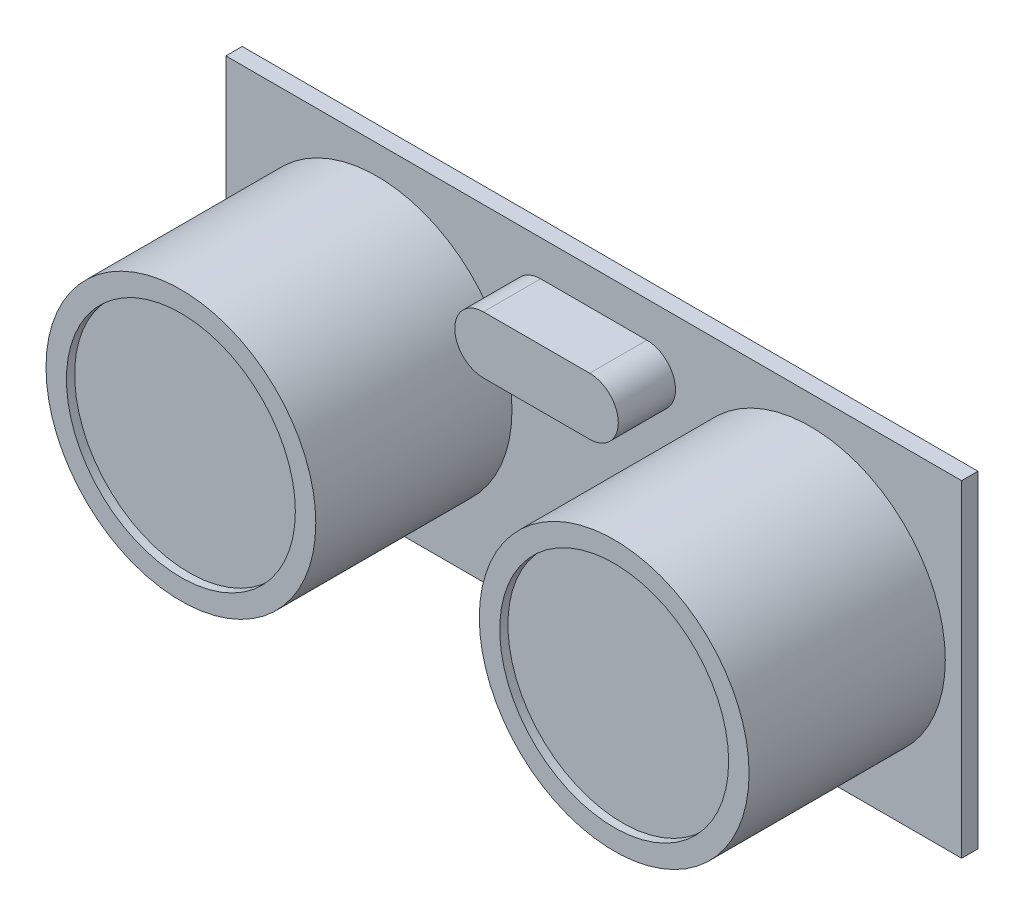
from build123d import *

# Parameters (mm, degrees)
ESBO_O1_W                = 45
ESBO_O1_H                = 20
RESSALTO_EXTRUS_O1_DEPTH = 1
ESBO_O2_R                = 8.25
RESSALTO_EXTRUS_O2_DEPTH = 12
ESBO_O3_R                = 7
CORTE_EXTRUS_O1_DEPTH    = 0.5
ESBO_O6_R                = 1.75
RESSALTO_EXTRUS_O5_DEPTH = 3.5
ESBO_O7_W                = 1.8
ESBO_O7_H                = 1.8
ESBO_O7_W_2              = 0.9
ESBO_O7_H_2              = 0.1
RESSALTO_EXTRUS_O6_DEPTH = 2
ESBO_O9_W                = 10
ESBO_O9_H                = 0.1
CORTE_EXTRUS_O2_DEPTH    = 2
ESBO_O10_W               = 1
ESBO_O10_H               = 1
RESSALTO_EXTRUS_O7_DEPTH = 2
ESBO_O11_W               = 1
ESBO_O11_H               = 1
ESBO_O11_H_2             = 0.967747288
RESSALTO_EXTRUS_O8_DEPTH = 4


with BuildPart() as part:
    # Esbo_o1 → Ressalto-extrus_o1 (new body)
    with BuildSketch(Plane.XY):
        with Locations((22.5, 10)):
            Rectangle(ESBO_O1_W, ESBO_O1_H)
    extrude(amount=RESSALTO_EXTRUS_O1_DEPTH)

    # Esbo_o2 → Ressalto-extrus_o2 (add)
    with BuildSketch(Plane.XY.offset(1)):
        with Locations(Location((9.25, 10, 0), (0, 0, 180))):
            Circle(ESBO_O2_R)
        with Locations(Location((35.75, 10, 0), (0, 0, 180))):
            Circle(ESBO_O2_R)
    extrude(amount=RESSALTO_EXTRUS_O2_DEPTH)

    # Esbo_o3 → Corte-extrus_o1 (cut)
    with BuildSketch(Plane.XY.offset(13)):
        with Locations((9.25, 10)):
            Circle(ESBO_O3_R)
        with Locations((35.75, 10)):
            Circle(ESBO_O3_R)
    extrude(amount=-CORTE_EXTRUS_O1_DEPTH, mode=Mode.SUBTRACT)

    # Esbo_o6 → Ressalto-extrus_o5 (add)
    with BuildSketch(Plane.XY.offset(1)):
        with Locations((19.25, 16.066758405)):
            Circle(ESBO_O6_R)
        with BuildLine():
            Line((22.5, 14.316758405), (22.5, 17.816758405))
            Line((22.5, 17.816758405), (19.25, 17.816758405))
            ThreePointArc((19.25, 17.816758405), (20.487436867, 17.304195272), (21, 16.066758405))
            ThreePointArc((21, 16.066758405), (20.487436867, 14.829321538), (19.25, 14.316758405))
            Line((19.25, 14.316758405), (22.5, 14.316758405))
        make_face()
        with BuildLine():
            Line((25.75, 17.816758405), (22.5, 17.816758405))
            Line((22.5, 17.816758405), (22.5, 14.316758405))
            Line((22.5, 14.316758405), (25.75, 14.316758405))
            ThreePointArc((25.75, 14.316758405), (24, 16.066758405), (25.75, 17.816758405))
        make_face()
        with Locations((25.75, 16.066758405)):
            Circle(ESBO_O6_R)
    extrude(amount=RESSALTO_EXTRUS_O5_DEPTH)

    # Esbo_o7 → Ressalto-extrus_o6 (add)
    with BuildSketch(Plane(origin=(0, 0, 0), x_dir=(-1, 0, 0), z_dir=(0, 0, -1))):
        with Locations((-26.5, 1)):
            Rectangle(ESBO_O7_W, ESBO_O7_H)
        with Locations((-24.5, 1)):
            Rectangle(ESBO_O7_W, ESBO_O7_H)
        with Locations((-22.95, 1)):
            Rectangle(ESBO_O7_W_2, ESBO_O7_H)
        with Locations((-22.05, 1)):
            Rectangle(ESBO_O7_W_2, ESBO_O7_H)
        with Locations((-20.5, 1)):
            Rectangle(ESBO_O7_W, ESBO_O7_H)
        with Locations((-18.5, 1)):
            Rectangle(ESBO_O7_W, ESBO_O7_H)
        Polygon((-27.5, 2), (-27.5, 0), (-25.6, 0), (-25.6, 0.1), (-27.4, 0.1), (-27.4, 1.9), (-25.6, 1.9), (-25.6, 2), align=None)
        with Locations((-24.5, 1.95)):
            Rectangle(ESBO_O7_W, ESBO_O7_H_2)
        with Locations((-22.95, 1.95)):
            Rectangle(ESBO_O7_W_2, ESBO_O7_H_2)
        with Locations((-22.05, 1.95)):
            Rectangle(ESBO_O7_W_2, ESBO_O7_H_2)
        with Locations((-20.5, 1.95)):
            Rectangle(ESBO_O7_W, ESBO_O7_H_2)
        Polygon((-19.4, 0), (-17.5, 0), (-17.5, 2), (-19.4, 2), (-19.4, 1.9), (-17.6, 1.9), (-17.6, 0.1), (-19.4, 0.1), align=None)
        with Locations((-24.5, 0.05)):
            Rectangle(ESBO_O7_W, ESBO_O7_H_2)
        with Locations((-22.95, 0.05)):
            Rectangle(ESBO_O7_W_2, ESBO_O7_H_2)
        with Locations((-22.05, 0.05)):
            Rectangle(ESBO_O7_W_2, ESBO_O7_H_2)
        with Locations((-20.5, 0.05)):
            Rectangle(ESBO_O7_W, ESBO_O7_H_2)
    extrude(amount=RESSALTO_EXTRUS_O6_DEPTH)

    # Esbo_o9 → Corte-extrus_o2 (cut)
    with BuildSketch(Plane(origin=(0, 0, -2), x_dir=(-1, 0, 0), z_dir=(0, 0, -1))):
        with Locations((-22.5, 0.05)):
            Rectangle(ESBO_O9_W, ESBO_O9_H)
    extrude(amount=-CORTE_EXTRUS_O2_DEPTH, mode=Mode.SUBTRACT)

    # Esbo_o10 → Ressalto-extrus_o7 (add)
    with BuildSketch(Plane(origin=(0, 0, -2), x_dir=(-1, 0, 0), z_dir=(0, 0, -1))):
        with Locations((-24.5, 1.05)):
            Rectangle(ESBO_O10_W, ESBO_O10_H)
        with Locations((-26.55, 1.05)):
            Rectangle(ESBO_O10_W, ESBO_O10_H)
        with Locations((-22.472435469, 1.05)):
            Rectangle(ESBO_O10_W, ESBO_O10_H)
        with Locations((-20.46939422, 1.05)):
            Rectangle(ESBO_O10_W, ESBO_O10_H)
        with Locations((-18.471440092, 1.05)):
            Rectangle(ESBO_O10_W, ESBO_O10_H)
    extrude(amount=RESSALTO_EXTRUS_O7_DEPTH)

    # Esbo_o11 → Ressalto-extrus_o8 (add)
    with BuildSketch(Plane.XZ.offset(-0.55)):
        with Locations((26.55, -3.5)):
            Rectangle(ESBO_O11_W, ESBO_O11_H)
        with Locations((24.5, -3.5)):
            Rectangle(ESBO_O11_W, ESBO_O11_H)
        with Locations((22.472435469, -3.516126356)):
            Rectangle(ESBO_O11_W, ESBO_O11_H_2)
        with Locations((20.46939422, -3.516126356)):
            Rectangle(ESBO_O11_W, ESBO_O11_H_2)
        with Locations((18.471440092, -3.516126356)):
            Rectangle(ESBO_O11_W, ESBO_O11_H_2)
    extrude(amount=RESSALTO_EXTRUS_O8_DEPTH)


solid = part.part
